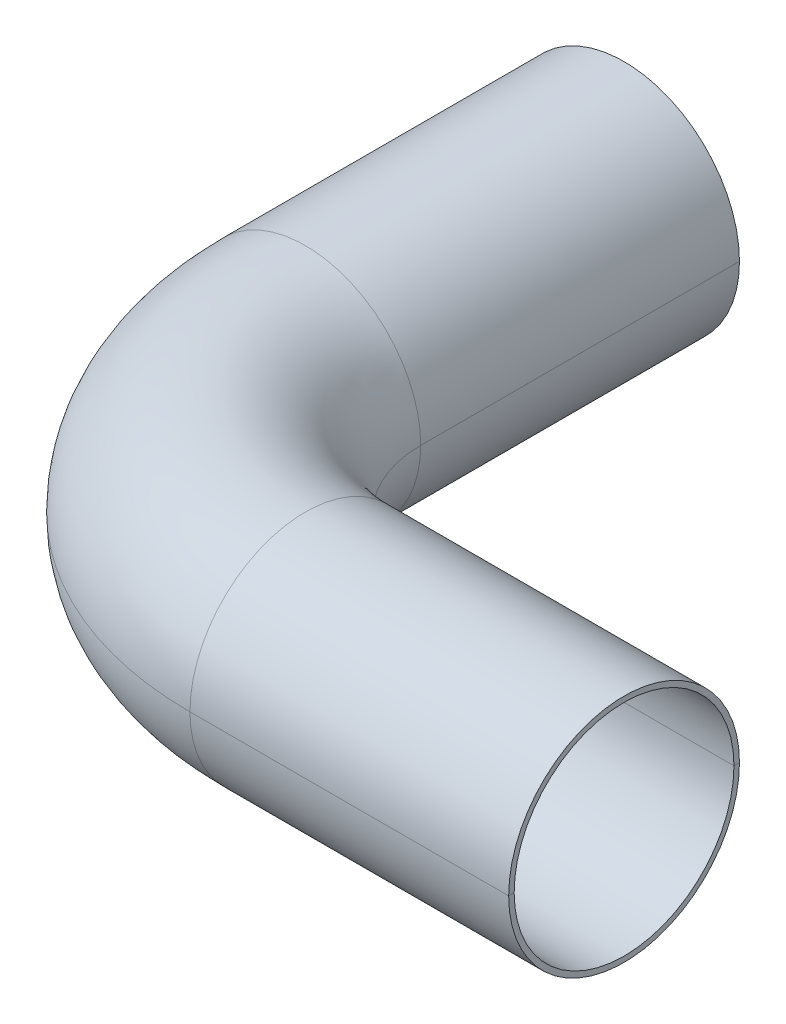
ISO-10303-21;
HEADER;
FILE_DESCRIPTION(('STEP AP214'),'2;1');
FILE_NAME('part.step','',(''),(''),'','','');
FILE_SCHEMA(('AUTOMOTIVE_DESIGN { 1 0 10303 214 1 1 1 1 }'));
ENDSEC;
DATA;
#1=APPLICATION_CONTEXT('core data for automotive mechanical design processes');
#2=APPLICATION_PROTOCOL_DEFINITION('international standard','automotive_design',2000,#1);
#3=PRODUCT_CONTEXT('',#1,'mechanical');
#4=PRODUCT('Part','Part','',(#3));
#5=PRODUCT_RELATED_PRODUCT_CATEGORY('part','',(#4));
#6=PRODUCT_DEFINITION_FORMATION('','',#4);
#7=PRODUCT_DEFINITION_CONTEXT('part definition',#1,'design');
#8=PRODUCT_DEFINITION('design','',#6,#7);
#9=PRODUCT_DEFINITION_SHAPE('','',#8);
#10=(LENGTH_UNIT() NAMED_UNIT(*) SI_UNIT(.MILLI.,.METRE.));
#11=(NAMED_UNIT(*) PLANE_ANGLE_UNIT() SI_UNIT($,.RADIAN.));
#12=(NAMED_UNIT(*) SI_UNIT($,.STERADIAN.) SOLID_ANGLE_UNIT());
#13=UNCERTAINTY_MEASURE_WITH_UNIT(LENGTH_MEASURE(1.E-05),#10,'distance_accuracy_value','');
#14=(GEOMETRIC_REPRESENTATION_CONTEXT(3) GLOBAL_UNCERTAINTY_ASSIGNED_CONTEXT((#13)) GLOBAL_UNIT_ASSIGNED_CONTEXT((#10,
#11,#12)) REPRESENTATION_CONTEXT('',''));
#15=CARTESIAN_POINT('',(0.,0.,0.));
#16=DIRECTION('',(0.,0.,1.));
#17=DIRECTION('',(1.,0.,0.));
#18=AXIS2_PLACEMENT_3D('',#15,#16,#17);
#19=CARTESIAN_POINT('',(106.68,-53.35,377.268224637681));
#20=DIRECTION('',(1.,0.,0.));
#21=DIRECTION('',(0.,0.,-1.));
#22=AXIS2_PLACEMENT_3D('',#19,#20,#21);
#23=PLANE('',#22);
#24=CARTESIAN_POINT('',(106.68,0.,254.));
#25=DIRECTION('',(1.,0.,0.));
#26=DIRECTION('',(0.,0.,-1.));
#27=AXIS2_PLACEMENT_3D('',#24,#25,#26);
#28=CIRCLE('',#27,53.34);
#29=CARTESIAN_POINT('',(106.68,0.,200.66));
#30=VERTEX_POINT('',#29);
#31=CARTESIAN_POINT('',(106.68,0.,307.34));
#32=VERTEX_POINT('',#31);
#33=EDGE_CURVE('E93',#30,#32,#28,.T.);
#34=ORIENTED_EDGE('',*,*,#33,.T.);
#35=DIRECTION('',(0.,0.,1.));
#36=VECTOR('',#35,1.);
#37=CARTESIAN_POINT('',(106.68,0.,-0.01));
#38=LINE('',#37,#36);
#39=CARTESIAN_POINT('',(106.68,0.,304.8));
#40=VERTEX_POINT('',#39);
#41=EDGE_CURVE('E100',#40,#32,#38,.T.);
#42=ORIENTED_EDGE('',*,*,#41,.F.);
#43=CARTESIAN_POINT('',(106.68,0.,254.));
#44=DIRECTION('',(1.,0.,0.));
#45=DIRECTION('',(0.,0.,-1.));
#46=AXIS2_PLACEMENT_3D('',#43,#44,#45);
#47=CIRCLE('',#46,50.8);
#48=CARTESIAN_POINT('',(106.68,0.,203.2));
#49=VERTEX_POINT('',#48);
#50=EDGE_CURVE('E53',#49,#40,#47,.T.);
#51=ORIENTED_EDGE('',*,*,#50,.F.);
#52=DIRECTION('',(0.,0.,1.));
#53=VECTOR('',#52,1.);
#54=CARTESIAN_POINT('',(106.68,0.,-0.01));
#55=LINE('',#54,#53);
#56=EDGE_CURVE('E107',#30,#49,#55,.T.);
#57=ORIENTED_EDGE('',*,*,#56,.F.);
#58=EDGE_LOOP('',(#34,#42,#51,#57));
#59=FACE_BOUND('',#58,.T.);
#60=ADVANCED_FACE('F49',(#59),#23,.T.);
#61=CARTESIAN_POINT('',(106.68,-53.35,147.32));
#62=DIRECTION('',(0.,0.,-1.));
#63=DIRECTION('',(-1.,0.,0.));
#64=AXIS2_PLACEMENT_3D('',#61,#62,#63);
#65=PLANE('',#64);
#66=DIRECTION('',(1.,0.,0.));
#67=VECTOR('',#66,1.);
#68=CARTESIAN_POINT('',(-95.1259909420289,0.,147.32));
#69=LINE('',#68,#67);
#70=CARTESIAN_POINT('',(50.8,0.,147.32));
#71=VERTEX_POINT('',#70);
#72=CARTESIAN_POINT('',(53.34,0.,147.32));
#73=VERTEX_POINT('',#72);
#74=EDGE_CURVE('E112',#71,#73,#69,.T.);
#75=ORIENTED_EDGE('',*,*,#74,.F.);
#76=CARTESIAN_POINT('',(0.,0.,147.32));
#77=DIRECTION('',(0.,0.,1.));
#78=DIRECTION('',(1.,0.,0.));
#79=AXIS2_PLACEMENT_3D('',#76,#77,#78);
#80=CIRCLE('',#79,50.8);
#81=CARTESIAN_POINT('',(-50.8,0.,147.32));
#82=VERTEX_POINT('',#81);
#83=EDGE_CURVE('E103',#71,#82,#80,.T.);
#84=ORIENTED_EDGE('',*,*,#83,.T.);
#85=DIRECTION('',(1.,0.,0.));
#86=VECTOR('',#85,1.);
#87=CARTESIAN_POINT('',(-95.1259909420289,0.,147.32));
#88=LINE('',#87,#86);
#89=CARTESIAN_POINT('',(-53.34,0.,147.32));
#90=VERTEX_POINT('',#89);
#91=EDGE_CURVE('E102',#90,#82,#88,.T.);
#92=ORIENTED_EDGE('',*,*,#91,.F.);
#93=CARTESIAN_POINT('',(0.,0.,147.32));
#94=DIRECTION('',(0.,0.,1.));
#95=DIRECTION('',(1.,0.,0.));
#96=AXIS2_PLACEMENT_3D('',#93,#94,#95);
#97=CIRCLE('',#96,53.34);
#98=EDGE_CURVE('E66',#73,#90,#97,.T.);
#99=ORIENTED_EDGE('',*,*,#98,.F.);
#100=EDGE_LOOP('',(#75,#84,#92,#99));
#101=FACE_BOUND('',#100,.T.);
#102=ADVANCED_FACE('F123',(#101),#65,.T.);
#103=CARTESIAN_POINT('',(-95.1259909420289,0.,-0.01));
#104=DIRECTION('',(0.,-1.,0.));
#105=DIRECTION('',(0.,0.,-1.));
#106=AXIS2_PLACEMENT_3D('',#103,#104,#105);
#107=PLANE('',#106);
#108=CARTESIAN_POINT('',(106.68,0.,147.32));
#109=DIRECTION('',(0.,1.,0.));
#110=DIRECTION('',(0.,0.,1.));
#111=AXIS2_PLACEMENT_3D('',#108,#109,#110);
#112=CIRCLE('',#111,53.34);
#113=EDGE_CURVE('E96',#30,#73,#112,.F.);
#114=ORIENTED_EDGE('',*,*,#113,.F.);
#115=ORIENTED_EDGE('',*,*,#56,.T.);
#116=CARTESIAN_POINT('',(106.68,0.,147.32));
#117=DIRECTION('',(0.,1.,0.));
#118=DIRECTION('',(0.,0.,1.));
#119=AXIS2_PLACEMENT_3D('',#116,#117,#118);
#120=CIRCLE('',#119,55.88);
#121=EDGE_CURVE('E13',#49,#71,#120,.F.);
#122=ORIENTED_EDGE('',*,*,#121,.T.);
#123=ORIENTED_EDGE('',*,*,#74,.T.);
#124=EDGE_LOOP('',(#114,#115,#122,#123));
#125=FACE_BOUND('',#124,.T.);
#126=ADVANCED_FACE('F122',(#125),#107,.T.);
#127=CARTESIAN_POINT('',(106.68,0.,147.32));
#128=DIRECTION('',(0.,-1.,0.));
#129=DIRECTION('',(0.,0.,-1.));
#130=AXIS2_PLACEMENT_3D('',#127,#128,#129);
#131=CIRCLE('',#130,157.48);
#132=EDGE_CURVE('E58',#82,#40,#131,.F.);
#133=ORIENTED_EDGE('',*,*,#132,.T.);
#134=ORIENTED_EDGE('',*,*,#41,.T.);
#135=CARTESIAN_POINT('',(106.68,0.,147.32));
#136=DIRECTION('',(0.,-1.,0.));
#137=DIRECTION('',(0.,0.,-1.));
#138=AXIS2_PLACEMENT_3D('',#135,#136,#137);
#139=CIRCLE('',#138,160.02);
#140=EDGE_CURVE('E89',#90,#32,#139,.F.);
#141=ORIENTED_EDGE('',*,*,#140,.F.);
#142=ORIENTED_EDGE('',*,*,#91,.T.);
#143=EDGE_LOOP('',(#133,#134,#141,#142));
#144=FACE_BOUND('',#143,.T.);
#145=ADVANCED_FACE('F51',(#144),#107,.T.);
#146=CARTESIAN_POINT('',(106.68,0.,147.32));
#147=DIRECTION('',(0.,1.,0.));
#148=DIRECTION('',(0.,0.,1.));
#149=AXIS2_PLACEMENT_3D('',#146,#147,#148);
#150=TOROIDAL_SURFACE('',#149,106.68,53.34);
#151=ORIENTED_EDGE('',*,*,#98,.T.);
#152=ORIENTED_EDGE('',*,*,#140,.T.);
#153=ORIENTED_EDGE('',*,*,#33,.F.);
#154=ORIENTED_EDGE('',*,*,#113,.T.);
#155=EDGE_LOOP('',(#151,#152,#153,#154));
#156=FACE_BOUND('',#155,.T.);
#157=ADVANCED_FACE('F91',(#156),#150,.T.);
#158=CARTESIAN_POINT('',(106.68,0.,147.32));
#159=DIRECTION('',(0.,1.,0.));
#160=DIRECTION('',(0.,0.,1.));
#161=AXIS2_PLACEMENT_3D('',#158,#159,#160);
#162=TOROIDAL_SURFACE('',#161,106.68,50.8);
#163=ORIENTED_EDGE('',*,*,#132,.F.);
#164=ORIENTED_EDGE('',*,*,#83,.F.);
#165=ORIENTED_EDGE('',*,*,#121,.F.);
#166=ORIENTED_EDGE('',*,*,#50,.T.);
#167=EDGE_LOOP('',(#163,#164,#165,#166));
#168=FACE_BOUND('',#167,.T.);
#169=ADVANCED_FACE('F120',(#168),#162,.F.);
#170=CLOSED_SHELL('',(#60,#102,#126,#145,#157,#169));
#171=MANIFOLD_SOLID_BREP('B2',#170);
#172=CARTESIAN_POINT('',(106.68,-53.35,377.268224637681));
#173=DIRECTION('',(1.,0.,0.));
#174=DIRECTION('',(0.,0.,-1.));
#175=AXIS2_PLACEMENT_3D('',#172,#173,#174);
#176=PLANE('',#175);
#177=CARTESIAN_POINT('',(106.68,0.,254.));
#178=DIRECTION('',(1.,0.,0.));
#179=DIRECTION('',(0.,0.,-1.));
#180=AXIS2_PLACEMENT_3D('',#177,#178,#179);
#181=CIRCLE('',#180,53.34);
#182=CARTESIAN_POINT('',(106.68,0.,200.66));
#183=VERTEX_POINT('',#182);
#184=CARTESIAN_POINT('',(106.68,0.,307.34));
#185=VERTEX_POINT('',#184);
#186=EDGE_CURVE('E230',#183,#185,#181,.T.);
#187=ORIENTED_EDGE('',*,*,#186,.F.);
#188=DIRECTION('',(0.,0.,1.));
#189=VECTOR('',#188,1.);
#190=CARTESIAN_POINT('',(106.68,0.,-0.01));
#191=LINE('',#190,#189);
#192=CARTESIAN_POINT('',(106.68,0.,203.2));
#193=VERTEX_POINT('',#192);
#194=EDGE_CURVE('E207',#183,#193,#191,.T.);
#195=ORIENTED_EDGE('',*,*,#194,.T.);
#196=CARTESIAN_POINT('',(106.68,0.,254.));
#197=DIRECTION('',(1.,0.,0.));
#198=DIRECTION('',(0.,0.,-1.));
#199=AXIS2_PLACEMENT_3D('',#196,#197,#198);
#200=CIRCLE('',#199,50.8);
#201=CARTESIAN_POINT('',(106.68,0.,304.8));
#202=VERTEX_POINT('',#201);
#203=EDGE_CURVE('E186',#193,#202,#200,.T.);
#204=ORIENTED_EDGE('',*,*,#203,.T.);
#205=DIRECTION('',(0.,0.,1.));
#206=VECTOR('',#205,1.);
#207=CARTESIAN_POINT('',(106.68,0.,-0.01));
#208=LINE('',#207,#206);
#209=EDGE_CURVE('E199',#202,#185,#208,.T.);
#210=ORIENTED_EDGE('',*,*,#209,.T.);
#211=EDGE_LOOP('',(#187,#195,#204,#210));
#212=FACE_BOUND('',#211,.T.);
#213=ADVANCED_FACE('F182',(#212),#176,.F.);
#214=CARTESIAN_POINT('',(-95.1259909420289,0.,-0.01));
#215=DIRECTION('',(0.,-1.,0.));
#216=DIRECTION('',(0.,0.,-1.));
#217=AXIS2_PLACEMENT_3D('',#214,#215,#216);
#218=PLANE('',#217);
#219=ORIENTED_EDGE('',*,*,#209,.F.);
#220=DIRECTION('',(1.,0.,0.));
#221=VECTOR('',#220,1.);
#222=CARTESIAN_POINT('',(106.68,0.,304.8));
#223=LINE('',#222,#221);
#224=CARTESIAN_POINT('',(254.,0.,304.8));
#225=VERTEX_POINT('',#224);
#226=EDGE_CURVE('E47',#202,#225,#223,.T.);
#227=ORIENTED_EDGE('',*,*,#226,.T.);
#228=DIRECTION('',(0.,0.,-1.));
#229=VECTOR('',#228,1.);
#230=CARTESIAN_POINT('',(254.,0.,254.));
#231=LINE('',#230,#229);
#232=CARTESIAN_POINT('',(254.,0.,307.34));
#233=VERTEX_POINT('',#232);
#234=EDGE_CURVE('E241',#233,#225,#231,.T.);
#235=ORIENTED_EDGE('',*,*,#234,.F.);
#236=DIRECTION('',(1.,0.,0.));
#237=VECTOR('',#236,1.);
#238=CARTESIAN_POINT('',(106.68,0.,307.34));
#239=LINE('',#238,#237);
#240=EDGE_CURVE('E235',#185,#233,#239,.T.);
#241=ORIENTED_EDGE('',*,*,#240,.F.);
#242=EDGE_LOOP('',(#219,#227,#235,#241));
#243=FACE_BOUND('',#242,.T.);
#244=ADVANCED_FACE('F255',(#243),#218,.T.);
#245=ORIENTED_EDGE('',*,*,#194,.F.);
#246=DIRECTION('',(1.,0.,0.));
#247=VECTOR('',#246,1.);
#248=CARTESIAN_POINT('',(106.68,0.,200.66));
#249=LINE('',#248,#247);
#250=CARTESIAN_POINT('',(254.,0.,200.66));
#251=VERTEX_POINT('',#250);
#252=EDGE_CURVE('E233',#251,#183,#249,.F.);
#253=ORIENTED_EDGE('',*,*,#252,.F.);
#254=CARTESIAN_POINT('',(254.,0.,203.2));
#255=VERTEX_POINT('',#254);
#256=EDGE_CURVE('E232',#255,#251,#231,.T.);
#257=ORIENTED_EDGE('',*,*,#256,.F.);
#258=DIRECTION('',(1.,0.,0.));
#259=VECTOR('',#258,1.);
#260=CARTESIAN_POINT('',(106.68,0.,203.2));
#261=LINE('',#260,#259);
#262=EDGE_CURVE('E191',#255,#193,#261,.F.);
#263=ORIENTED_EDGE('',*,*,#262,.T.);
#264=EDGE_LOOP('',(#245,#253,#257,#263));
#265=FACE_BOUND('',#264,.T.);
#266=ADVANCED_FACE('F184',(#265),#218,.T.);
#267=CARTESIAN_POINT('',(106.68,0.,254.));
#268=DIRECTION('',(1.,0.,0.));
#269=DIRECTION('',(0.,0.,-1.));
#270=AXIS2_PLACEMENT_3D('',#267,#268,#269);
#271=CYLINDRICAL_SURFACE('',#270,53.34);
#272=CARTESIAN_POINT('',(254.,0.,254.));
#273=DIRECTION('',(1.,0.,0.));
#274=DIRECTION('',(0.,0.,-1.));
#275=AXIS2_PLACEMENT_3D('',#272,#273,#274);
#276=CIRCLE('',#275,53.34);
#277=EDGE_CURVE('E247',#251,#233,#276,.T.);
#278=ORIENTED_EDGE('',*,*,#277,.F.);
#279=ORIENTED_EDGE('',*,*,#252,.T.);
#280=ORIENTED_EDGE('',*,*,#186,.T.);
#281=ORIENTED_EDGE('',*,*,#240,.T.);
#282=EDGE_LOOP('',(#278,#279,#280,#281));
#283=FACE_BOUND('',#282,.T.);
#284=ADVANCED_FACE('F253',(#283),#271,.T.);
#285=CARTESIAN_POINT('',(106.68,0.,254.));
#286=DIRECTION('',(1.,0.,0.));
#287=DIRECTION('',(0.,0.,-1.));
#288=AXIS2_PLACEMENT_3D('',#285,#286,#287);
#289=CYLINDRICAL_SURFACE('',#288,50.8);
#290=ORIENTED_EDGE('',*,*,#262,.F.);
#291=CARTESIAN_POINT('',(254.,0.,254.));
#292=DIRECTION('',(1.,0.,0.));
#293=DIRECTION('',(0.,0.,-1.));
#294=AXIS2_PLACEMENT_3D('',#291,#292,#293);
#295=CIRCLE('',#294,50.8);
#296=EDGE_CURVE('E243',#255,#225,#295,.T.);
#297=ORIENTED_EDGE('',*,*,#296,.T.);
#298=ORIENTED_EDGE('',*,*,#226,.F.);
#299=ORIENTED_EDGE('',*,*,#203,.F.);
#300=EDGE_LOOP('',(#290,#297,#298,#299));
#301=FACE_BOUND('',#300,.T.);
#302=ADVANCED_FACE('F227',(#301),#289,.F.);
#303=CARTESIAN_POINT('',(254.,0.,254.));
#304=DIRECTION('',(1.,0.,0.));
#305=DIRECTION('',(0.,0.,-1.));
#306=AXIS2_PLACEMENT_3D('',#303,#304,#305);
#307=PLANE('',#306);
#308=ORIENTED_EDGE('',*,*,#277,.T.);
#309=ORIENTED_EDGE('',*,*,#234,.T.);
#310=ORIENTED_EDGE('',*,*,#296,.F.);
#311=ORIENTED_EDGE('',*,*,#256,.T.);
#312=EDGE_LOOP('',(#308,#309,#310,#311));
#313=FACE_BOUND('',#312,.T.);
#314=ADVANCED_FACE('F252',(#313),#307,.T.);
#315=CLOSED_SHELL('',(#213,#244,#266,#284,#302,#314));
#316=MANIFOLD_SOLID_BREP('B7',#315);
#317=CARTESIAN_POINT('',(106.68,-53.35,147.32));
#318=DIRECTION('',(0.,0.,-1.));
#319=DIRECTION('',(-1.,0.,0.));
#320=AXIS2_PLACEMENT_3D('',#317,#318,#319);
#321=PLANE('',#320);
#322=DIRECTION('',(1.,0.,0.));
#323=VECTOR('',#322,1.);
#324=CARTESIAN_POINT('',(-95.1259909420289,0.,147.32));
#325=LINE('',#324,#323);
#326=CARTESIAN_POINT('',(50.8,0.,147.32));
#327=VERTEX_POINT('',#326);
#328=CARTESIAN_POINT('',(53.34,0.,147.32));
#329=VERTEX_POINT('',#328);
#330=EDGE_CURVE('E317',#327,#329,#325,.T.);
#331=ORIENTED_EDGE('',*,*,#330,.T.);
#332=CARTESIAN_POINT('',(0.,0.,147.32));
#333=DIRECTION('',(0.,0.,1.));
#334=DIRECTION('',(1.,0.,0.));
#335=AXIS2_PLACEMENT_3D('',#332,#333,#334);
#336=CIRCLE('',#335,53.34);
#337=CARTESIAN_POINT('',(-53.34,0.,147.32));
#338=VERTEX_POINT('',#337);
#339=EDGE_CURVE('E180',#329,#338,#336,.T.);
#340=ORIENTED_EDGE('',*,*,#339,.T.);
#341=DIRECTION('',(1.,0.,0.));
#342=VECTOR('',#341,1.);
#343=CARTESIAN_POINT('',(-95.1259909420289,0.,147.32));
#344=LINE('',#343,#342);
#345=CARTESIAN_POINT('',(-50.8,0.,147.32));
#346=VERTEX_POINT('',#345);
#347=EDGE_CURVE('E335',#338,#346,#344,.T.);
#348=ORIENTED_EDGE('',*,*,#347,.T.);
#349=CARTESIAN_POINT('',(0.,0.,147.32));
#350=DIRECTION('',(0.,0.,1.));
#351=DIRECTION('',(1.,0.,0.));
#352=AXIS2_PLACEMENT_3D('',#349,#350,#351);
#353=CIRCLE('',#352,50.8);
#354=EDGE_CURVE('E373',#327,#346,#353,.T.);
#355=ORIENTED_EDGE('',*,*,#354,.F.);
#356=EDGE_LOOP('',(#331,#340,#348,#355));
#357=FACE_BOUND('',#356,.T.);
#358=ADVANCED_FACE('F314',(#357),#321,.F.);
#359=CARTESIAN_POINT('',(0.,0.,0.));
#360=DIRECTION('',(0.,0.,1.));
#361=DIRECTION('',(1.,0.,0.));
#362=AXIS2_PLACEMENT_3D('',#359,#360,#361);
#363=PLANE('',#362);
#364=DIRECTION('',(1.,0.,0.));
#365=VECTOR('',#364,1.);
#366=CARTESIAN_POINT('',(0.,0.,0.));
#367=LINE('',#366,#365);
#368=CARTESIAN_POINT('',(-53.34,0.,0.));
#369=VERTEX_POINT('',#368);
#370=CARTESIAN_POINT('',(-50.8,0.,0.));
#371=VERTEX_POINT('',#370);
#372=EDGE_CURVE('E376',#369,#371,#367,.T.);
#373=ORIENTED_EDGE('',*,*,#372,.F.);
#374=CARTESIAN_POINT('',(0.,0.,0.));
#375=DIRECTION('',(0.,0.,1.));
#376=DIRECTION('',(1.,0.,0.));
#377=AXIS2_PLACEMENT_3D('',#374,#375,#376);
#378=CIRCLE('',#377,53.34);
#379=CARTESIAN_POINT('',(53.34,0.,0.));
#380=VERTEX_POINT('',#379);
#381=EDGE_CURVE('E365',#380,#369,#378,.T.);
#382=ORIENTED_EDGE('',*,*,#381,.F.);
#383=CARTESIAN_POINT('',(50.8,0.,0.));
#384=VERTEX_POINT('',#383);
#385=EDGE_CURVE('E372',#384,#380,#367,.T.);
#386=ORIENTED_EDGE('',*,*,#385,.F.);
#387=CARTESIAN_POINT('',(0.,0.,0.));
#388=DIRECTION('',(0.,0.,1.));
#389=DIRECTION('',(1.,0.,0.));
#390=AXIS2_PLACEMENT_3D('',#387,#388,#389);
#391=CIRCLE('',#390,50.8);
#392=EDGE_CURVE('E356',#384,#371,#391,.T.);
#393=ORIENTED_EDGE('',*,*,#392,.T.);
#394=EDGE_LOOP('',(#373,#382,#386,#393));
#395=FACE_BOUND('',#394,.T.);
#396=ADVANCED_FACE('F375',(#395),#363,.F.);
#397=CARTESIAN_POINT('',(-95.1259909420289,0.,-0.01));
#398=DIRECTION('',(0.,-1.,0.));
#399=DIRECTION('',(0.,0.,-1.));
#400=AXIS2_PLACEMENT_3D('',#397,#398,#399);
#401=PLANE('',#400);
#402=ORIENTED_EDGE('',*,*,#330,.F.);
#403=DIRECTION('',(0.,0.,-1.));
#404=VECTOR('',#403,1.);
#405=CARTESIAN_POINT('',(50.8,0.,147.32));
#406=LINE('',#405,#404);
#407=EDGE_CURVE('E359',#384,#327,#406,.F.);
#408=ORIENTED_EDGE('',*,*,#407,.F.);
#409=ORIENTED_EDGE('',*,*,#385,.T.);
#410=DIRECTION('',(0.,0.,-1.));
#411=VECTOR('',#410,1.);
#412=CARTESIAN_POINT('',(53.34,0.,147.32));
#413=LINE('',#412,#411);
#414=EDGE_CURVE('E378',#380,#329,#413,.F.);
#415=ORIENTED_EDGE('',*,*,#414,.T.);
#416=EDGE_LOOP('',(#402,#408,#409,#415));
#417=FACE_BOUND('',#416,.T.);
#418=ADVANCED_FACE('F370',(#417),#401,.T.);
#419=ORIENTED_EDGE('',*,*,#347,.F.);
#420=DIRECTION('',(0.,0.,-1.));
#421=VECTOR('',#420,1.);
#422=CARTESIAN_POINT('',(-53.34,0.,147.32));
#423=LINE('',#422,#421);
#424=EDGE_CURVE('E384',#338,#369,#423,.T.);
#425=ORIENTED_EDGE('',*,*,#424,.T.);
#426=ORIENTED_EDGE('',*,*,#372,.T.);
#427=DIRECTION('',(0.,0.,-1.));
#428=VECTOR('',#427,1.);
#429=CARTESIAN_POINT('',(-50.8,0.,147.32));
#430=LINE('',#429,#428);
#431=EDGE_CURVE('E360',#346,#371,#430,.T.);
#432=ORIENTED_EDGE('',*,*,#431,.F.);
#433=EDGE_LOOP('',(#419,#425,#426,#432));
#434=FACE_BOUND('',#433,.T.);
#435=ADVANCED_FACE('F386',(#434),#401,.T.);
#436=CARTESIAN_POINT('',(0.,0.,147.32));
#437=DIRECTION('',(0.,0.,-1.));
#438=DIRECTION('',(-1.,0.,0.));
#439=AXIS2_PLACEMENT_3D('',#436,#437,#438);
#440=CYLINDRICAL_SURFACE('',#439,53.34);
#441=ORIENTED_EDGE('',*,*,#424,.F.);
#442=ORIENTED_EDGE('',*,*,#339,.F.);
#443=ORIENTED_EDGE('',*,*,#414,.F.);
#444=ORIENTED_EDGE('',*,*,#381,.T.);
#445=EDGE_LOOP('',(#441,#442,#443,#444));
#446=FACE_BOUND('',#445,.T.);
#447=ADVANCED_FACE('F387',(#446),#440,.T.);
#448=CARTESIAN_POINT('',(0.,0.,147.32));
#449=DIRECTION('',(0.,0.,-1.));
#450=DIRECTION('',(-1.,0.,0.));
#451=AXIS2_PLACEMENT_3D('',#448,#449,#450);
#452=CYLINDRICAL_SURFACE('',#451,50.8);
#453=ORIENTED_EDGE('',*,*,#354,.T.);
#454=ORIENTED_EDGE('',*,*,#431,.T.);
#455=ORIENTED_EDGE('',*,*,#392,.F.);
#456=ORIENTED_EDGE('',*,*,#407,.T.);
#457=EDGE_LOOP('',(#453,#454,#455,#456));
#458=FACE_BOUND('',#457,.T.);
#459=ADVANCED_FACE('F358',(#458),#452,.F.);
#460=CLOSED_SHELL('',(#358,#396,#418,#435,#447,#459));
#461=MANIFOLD_SOLID_BREP('B41',#460);
#462=CARTESIAN_POINT('',(106.68,-53.35,377.268224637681));
#463=DIRECTION('',(1.,0.,0.));
#464=DIRECTION('',(0.,0.,-1.));
#465=AXIS2_PLACEMENT_3D('',#462,#463,#464);
#466=PLANE('',#465);
#467=DIRECTION('',(0.,0.,1.));
#468=VECTOR('',#467,1.);
#469=CARTESIAN_POINT('',(106.68,0.,-0.01));
#470=LINE('',#469,#468);
#471=CARTESIAN_POINT('',(106.68,0.,200.66));
#472=VERTEX_POINT('',#471);
#473=CARTESIAN_POINT('',(106.68,0.,203.2));
#474=VERTEX_POINT('',#473);
#475=EDGE_CURVE('E502',#472,#474,#470,.T.);
#476=ORIENTED_EDGE('',*,*,#475,.T.);
#477=CARTESIAN_POINT('',(106.68,0.,254.));
#478=DIRECTION('',(1.,0.,0.));
#479=DIRECTION('',(0.,0.,-1.));
#480=AXIS2_PLACEMENT_3D('',#477,#478,#479);
#481=CIRCLE('',#480,50.8);
#482=CARTESIAN_POINT('',(106.68,0.,304.8));
#483=VERTEX_POINT('',#482);
#484=EDGE_CURVE('E449',#483,#474,#481,.T.);
#485=ORIENTED_EDGE('',*,*,#484,.F.);
#486=DIRECTION('',(0.,0.,1.));
#487=VECTOR('',#486,1.);
#488=CARTESIAN_POINT('',(106.68,0.,-0.01));
#489=LINE('',#488,#487);
#490=CARTESIAN_POINT('',(106.68,0.,307.34));
#491=VERTEX_POINT('',#490);
#492=EDGE_CURVE('E485',#483,#491,#489,.T.);
#493=ORIENTED_EDGE('',*,*,#492,.T.);
#494=CARTESIAN_POINT('',(106.68,0.,254.));
#495=DIRECTION('',(1.,0.,0.));
#496=DIRECTION('',(0.,0.,-1.));
#497=AXIS2_PLACEMENT_3D('',#494,#495,#496);
#498=CIRCLE('',#497,53.34);
#499=EDGE_CURVE('E495',#491,#472,#498,.T.);
#500=ORIENTED_EDGE('',*,*,#499,.T.);
#501=EDGE_LOOP('',(#476,#485,#493,#500));
#502=FACE_BOUND('',#501,.T.);
#503=ADVANCED_FACE('F445',(#502),#466,.T.);
#504=CARTESIAN_POINT('',(106.68,-53.35,147.32));
#505=DIRECTION('',(0.,0.,-1.));
#506=DIRECTION('',(-1.,0.,0.));
#507=AXIS2_PLACEMENT_3D('',#504,#505,#506);
#508=PLANE('',#507);
#509=CARTESIAN_POINT('',(0.,0.,147.32));
#510=DIRECTION('',(0.,0.,1.));
#511=DIRECTION('',(1.,0.,0.));
#512=AXIS2_PLACEMENT_3D('',#509,#510,#511);
#513=CIRCLE('',#512,50.8);
#514=CARTESIAN_POINT('',(-50.8,0.,147.32));
#515=VERTEX_POINT('',#514);
#516=CARTESIAN_POINT('',(50.8,0.,147.32));
#517=VERTEX_POINT('',#516);
#518=EDGE_CURVE('E500',#515,#517,#513,.T.);
#519=ORIENTED_EDGE('',*,*,#518,.T.);
#520=DIRECTION('',(1.,0.,0.));
#521=VECTOR('',#520,1.);
#522=CARTESIAN_POINT('',(-95.1259909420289,0.,147.32));
#523=LINE('',#522,#521);
#524=CARTESIAN_POINT('',(53.34,0.,147.32));
#525=VERTEX_POINT('',#524);
#526=EDGE_CURVE('E499',#517,#525,#523,.T.);
#527=ORIENTED_EDGE('',*,*,#526,.T.);
#528=CARTESIAN_POINT('',(0.,0.,147.32));
#529=DIRECTION('',(0.,0.,1.));
#530=DIRECTION('',(1.,0.,0.));
#531=AXIS2_PLACEMENT_3D('',#528,#529,#530);
#532=CIRCLE('',#531,53.34);
#533=CARTESIAN_POINT('',(-53.34,0.,147.32));
#534=VERTEX_POINT('',#533);
#535=EDGE_CURVE('E312',#534,#525,#532,.T.);
#536=ORIENTED_EDGE('',*,*,#535,.F.);
#537=DIRECTION('',(1.,0.,0.));
#538=VECTOR('',#537,1.);
#539=CARTESIAN_POINT('',(-95.1259909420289,0.,147.32));
#540=LINE('',#539,#538);
#541=EDGE_CURVE('E487',#534,#515,#540,.T.);
#542=ORIENTED_EDGE('',*,*,#541,.T.);
#543=EDGE_LOOP('',(#519,#527,#536,#542));
#544=FACE_BOUND('',#543,.T.);
#545=ADVANCED_FACE('F517',(#544),#508,.T.);
#546=CARTESIAN_POINT('',(-95.1259909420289,0.,-0.01));
#547=DIRECTION('',(0.,-1.,0.));
#548=DIRECTION('',(0.,0.,-1.));
#549=AXIS2_PLACEMENT_3D('',#546,#547,#548);
#550=PLANE('',#549);
#551=ORIENTED_EDGE('',*,*,#475,.F.);
#552=CARTESIAN_POINT('',(106.68,0.,147.32));
#553=DIRECTION('',(0.,1.,0.));
#554=DIRECTION('',(0.,0.,1.));
#555=AXIS2_PLACEMENT_3D('',#552,#553,#554);
#556=CIRCLE('',#555,53.34);
#557=EDGE_CURVE('E490',#472,#525,#556,.F.);
#558=ORIENTED_EDGE('',*,*,#557,.T.);
#559=ORIENTED_EDGE('',*,*,#526,.F.);
#560=CARTESIAN_POINT('',(106.68,0.,147.32));
#561=DIRECTION('',(0.,1.,0.));
#562=DIRECTION('',(0.,0.,1.));
#563=AXIS2_PLACEMENT_3D('',#560,#561,#562);
#564=CIRCLE('',#563,55.88);
#565=EDGE_CURVE('E511',#474,#517,#564,.F.);
#566=ORIENTED_EDGE('',*,*,#565,.F.);
#567=EDGE_LOOP('',(#551,#558,#559,#566));
#568=FACE_BOUND('',#567,.T.);
#569=ADVANCED_FACE('F519',(#568),#550,.F.);
#570=ORIENTED_EDGE('',*,*,#492,.F.);
#571=CARTESIAN_POINT('',(106.68,0.,147.32));
#572=DIRECTION('',(0.,-1.,0.));
#573=DIRECTION('',(0.,0.,-1.));
#574=AXIS2_PLACEMENT_3D('',#571,#572,#573);
#575=CIRCLE('',#574,157.48);
#576=EDGE_CURVE('E489',#515,#483,#575,.F.);
#577=ORIENTED_EDGE('',*,*,#576,.F.);
#578=ORIENTED_EDGE('',*,*,#541,.F.);
#579=CARTESIAN_POINT('',(106.68,0.,147.32));
#580=DIRECTION('',(0.,-1.,0.));
#581=DIRECTION('',(0.,0.,-1.));
#582=AXIS2_PLACEMENT_3D('',#579,#580,#581);
#583=CIRCLE('',#582,160.02);
#584=EDGE_CURVE('E483',#534,#491,#583,.F.);
#585=ORIENTED_EDGE('',*,*,#584,.T.);
#586=EDGE_LOOP('',(#570,#577,#578,#585));
#587=FACE_BOUND('',#586,.T.);
#588=ADVANCED_FACE('F447',(#587),#550,.F.);
#589=CARTESIAN_POINT('',(106.68,0.,147.32));
#590=DIRECTION('',(0.,1.,0.));
#591=DIRECTION('',(0.,0.,1.));
#592=AXIS2_PLACEMENT_3D('',#589,#590,#591);
#593=TOROIDAL_SURFACE('',#592,106.68,53.34);
#594=ORIENTED_EDGE('',*,*,#584,.F.);
#595=ORIENTED_EDGE('',*,*,#535,.T.);
#596=ORIENTED_EDGE('',*,*,#557,.F.);
#597=ORIENTED_EDGE('',*,*,#499,.F.);
#598=EDGE_LOOP('',(#594,#595,#596,#597));
#599=FACE_BOUND('',#598,.T.);
#600=ADVANCED_FACE('F496',(#599),#593,.T.);
#601=CARTESIAN_POINT('',(106.68,0.,147.32));
#602=DIRECTION('',(0.,1.,0.));
#603=DIRECTION('',(0.,0.,1.));
#604=AXIS2_PLACEMENT_3D('',#601,#602,#603);
#605=TOROIDAL_SURFACE('',#604,106.68,50.8);
#606=ORIENTED_EDGE('',*,*,#518,.F.);
#607=ORIENTED_EDGE('',*,*,#576,.T.);
#608=ORIENTED_EDGE('',*,*,#484,.T.);
#609=ORIENTED_EDGE('',*,*,#565,.T.);
#610=EDGE_LOOP('',(#606,#607,#608,#609));
#611=FACE_BOUND('',#610,.T.);
#612=ADVANCED_FACE('F515',(#611),#605,.F.);
#613=CLOSED_SHELL('',(#503,#545,#569,#588,#600,#612));
#614=MANIFOLD_SOLID_BREP('B174_NOT_SHOWN',#613);
#615=CARTESIAN_POINT('',(106.68,-53.35,377.268224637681));
#616=DIRECTION('',(1.,0.,0.));
#617=DIRECTION('',(0.,0.,-1.));
#618=AXIS2_PLACEMENT_3D('',#615,#616,#617);
#619=PLANE('',#618);
#620=DIRECTION('',(0.,0.,1.));
#621=VECTOR('',#620,1.);
#622=CARTESIAN_POINT('',(106.68,0.,-0.01));
#623=LINE('',#622,#621);
#624=CARTESIAN_POINT('',(106.68,0.,200.66));
#625=VERTEX_POINT('',#624);
#626=CARTESIAN_POINT('',(106.68,0.,203.2));
#627=VERTEX_POINT('',#626);
#628=EDGE_CURVE('E617',#625,#627,#623,.T.);
#629=ORIENTED_EDGE('',*,*,#628,.F.);
#630=CARTESIAN_POINT('',(106.68,0.,254.));
#631=DIRECTION('',(1.,0.,0.));
#632=DIRECTION('',(0.,0.,-1.));
#633=AXIS2_PLACEMENT_3D('',#630,#631,#632);
#634=CIRCLE('',#633,53.34);
#635=CARTESIAN_POINT('',(106.68,0.,307.34));
#636=VERTEX_POINT('',#635);
#637=EDGE_CURVE('E443',#636,#625,#634,.T.);
#638=ORIENTED_EDGE('',*,*,#637,.F.);
#639=DIRECTION('',(0.,0.,1.));
#640=VECTOR('',#639,1.);
#641=CARTESIAN_POINT('',(106.68,0.,-0.01));
#642=LINE('',#641,#640);
#643=CARTESIAN_POINT('',(106.68,0.,304.8));
#644=VERTEX_POINT('',#643);
#645=EDGE_CURVE('E593',#644,#636,#642,.T.);
#646=ORIENTED_EDGE('',*,*,#645,.F.);
#647=CARTESIAN_POINT('',(106.68,0.,254.));
#648=DIRECTION('',(1.,0.,0.));
#649=DIRECTION('',(0.,0.,-1.));
#650=AXIS2_PLACEMENT_3D('',#647,#648,#649);
#651=CIRCLE('',#650,50.8);
#652=EDGE_CURVE('E581',#644,#627,#651,.T.);
#653=ORIENTED_EDGE('',*,*,#652,.T.);
#654=EDGE_LOOP('',(#629,#638,#646,#653));
#655=FACE_BOUND('',#654,.T.);
#656=ADVANCED_FACE('F577',(#655),#619,.F.);
#657=CARTESIAN_POINT('',(-95.1259909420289,0.,-0.01));
#658=DIRECTION('',(0.,-1.,0.));
#659=DIRECTION('',(0.,0.,-1.));
#660=AXIS2_PLACEMENT_3D('',#657,#658,#659);
#661=PLANE('',#660);
#662=DIRECTION('',(1.,0.,0.));
#663=VECTOR('',#662,1.);
#664=CARTESIAN_POINT('',(106.68,0.,304.8));
#665=LINE('',#664,#663);
#666=CARTESIAN_POINT('',(254.,0.,304.8));
#667=VERTEX_POINT('',#666);
#668=EDGE_CURVE('E631',#644,#667,#665,.T.);
#669=ORIENTED_EDGE('',*,*,#668,.F.);
#670=ORIENTED_EDGE('',*,*,#645,.T.);
#671=DIRECTION('',(1.,0.,0.));
#672=VECTOR('',#671,1.);
#673=CARTESIAN_POINT('',(106.68,0.,307.34));
#674=LINE('',#673,#672);
#675=CARTESIAN_POINT('',(254.,0.,307.34));
#676=VERTEX_POINT('',#675);
#677=EDGE_CURVE('E635',#636,#676,#674,.T.);
#678=ORIENTED_EDGE('',*,*,#677,.T.);
#679=DIRECTION('',(0.,0.,-1.));
#680=VECTOR('',#679,1.);
#681=CARTESIAN_POINT('',(254.,0.,254.));
#682=LINE('',#681,#680);
#683=EDGE_CURVE('E640',#676,#667,#682,.T.);
#684=ORIENTED_EDGE('',*,*,#683,.T.);
#685=EDGE_LOOP('',(#669,#670,#678,#684));
#686=FACE_BOUND('',#685,.T.);
#687=ADVANCED_FACE('F650',(#686),#661,.F.);
#688=DIRECTION('',(1.,0.,0.));
#689=VECTOR('',#688,1.);
#690=CARTESIAN_POINT('',(106.68,0.,200.66));
#691=LINE('',#690,#689);
#692=CARTESIAN_POINT('',(254.,0.,200.66));
#693=VERTEX_POINT('',#692);
#694=EDGE_CURVE('E625',#693,#625,#691,.F.);
#695=ORIENTED_EDGE('',*,*,#694,.T.);
#696=ORIENTED_EDGE('',*,*,#628,.T.);
#697=DIRECTION('',(1.,0.,0.));
#698=VECTOR('',#697,1.);
#699=CARTESIAN_POINT('',(106.68,0.,203.2));
#700=LINE('',#699,#698);
#701=CARTESIAN_POINT('',(254.,0.,203.2));
#702=VERTEX_POINT('',#701);
#703=EDGE_CURVE('E623',#702,#627,#700,.F.);
#704=ORIENTED_EDGE('',*,*,#703,.F.);
#705=EDGE_CURVE('E626',#702,#693,#682,.T.);
#706=ORIENTED_EDGE('',*,*,#705,.T.);
#707=EDGE_LOOP('',(#695,#696,#704,#706));
#708=FACE_BOUND('',#707,.T.);
#709=ADVANCED_FACE('F579',(#708),#661,.F.);
#710=CARTESIAN_POINT('',(106.68,0.,254.));
#711=DIRECTION('',(1.,0.,0.));
#712=DIRECTION('',(0.,0.,-1.));
#713=AXIS2_PLACEMENT_3D('',#710,#711,#712);
#714=CYLINDRICAL_SURFACE('',#713,50.8);
#715=CARTESIAN_POINT('',(254.,0.,254.));
#716=DIRECTION('',(1.,0.,0.));
#717=DIRECTION('',(0.,0.,-1.));
#718=AXIS2_PLACEMENT_3D('',#715,#716,#717);
#719=CIRCLE('',#718,50.8);
#720=EDGE_CURVE('E586',#667,#702,#719,.T.);
#721=ORIENTED_EDGE('',*,*,#720,.T.);
#722=ORIENTED_EDGE('',*,*,#703,.T.);
#723=ORIENTED_EDGE('',*,*,#652,.F.);
#724=ORIENTED_EDGE('',*,*,#668,.T.);
#725=EDGE_LOOP('',(#721,#722,#723,#724));
#726=FACE_BOUND('',#725,.T.);
#727=ADVANCED_FACE('F629',(#726),#714,.F.);
#728=CARTESIAN_POINT('',(106.68,0.,254.));
#729=DIRECTION('',(1.,0.,0.));
#730=DIRECTION('',(0.,0.,-1.));
#731=AXIS2_PLACEMENT_3D('',#728,#729,#730);
#732=CYLINDRICAL_SURFACE('',#731,53.34);
#733=ORIENTED_EDGE('',*,*,#694,.F.);
#734=CARTESIAN_POINT('',(254.,0.,254.));
#735=DIRECTION('',(1.,0.,0.));
#736=DIRECTION('',(0.,0.,-1.));
#737=AXIS2_PLACEMENT_3D('',#734,#735,#736);
#738=CIRCLE('',#737,53.34);
#739=EDGE_CURVE('E633',#676,#693,#738,.T.);
#740=ORIENTED_EDGE('',*,*,#739,.F.);
#741=ORIENTED_EDGE('',*,*,#677,.F.);
#742=ORIENTED_EDGE('',*,*,#637,.T.);
#743=EDGE_LOOP('',(#733,#740,#741,#742));
#744=FACE_BOUND('',#743,.T.);
#745=ADVANCED_FACE('F648',(#744),#732,.T.);
#746=CARTESIAN_POINT('',(254.,0.,254.));
#747=DIRECTION('',(1.,0.,0.));
#748=DIRECTION('',(0.,0.,-1.));
#749=AXIS2_PLACEMENT_3D('',#746,#747,#748);
#750=PLANE('',#749);
#751=ORIENTED_EDGE('',*,*,#683,.F.);
#752=ORIENTED_EDGE('',*,*,#739,.T.);
#753=ORIENTED_EDGE('',*,*,#705,.F.);
#754=ORIENTED_EDGE('',*,*,#720,.F.);
#755=EDGE_LOOP('',(#751,#752,#753,#754));
#756=FACE_BOUND('',#755,.T.);
#757=ADVANCED_FACE('F646',(#756),#750,.T.);
#758=CLOSED_SHELL('',(#656,#687,#709,#727,#745,#757));
#759=MANIFOLD_SOLID_BREP('B306',#758);
#760=CARTESIAN_POINT('',(106.68,-53.35,147.32));
#761=DIRECTION('',(0.,0.,-1.));
#762=DIRECTION('',(-1.,0.,0.));
#763=AXIS2_PLACEMENT_3D('',#760,#761,#762);
#764=PLANE('',#763);
#765=CARTESIAN_POINT('',(0.,0.,147.32));
#766=DIRECTION('',(0.,0.,1.));
#767=DIRECTION('',(1.,0.,0.));
#768=AXIS2_PLACEMENT_3D('',#765,#766,#767);
#769=CIRCLE('',#768,50.8);
#770=CARTESIAN_POINT('',(-50.8,0.,147.32));
#771=VERTEX_POINT('',#770);
#772=CARTESIAN_POINT('',(50.8,0.,147.32));
#773=VERTEX_POINT('',#772);
#774=EDGE_CURVE('E746',#771,#773,#769,.T.);
#775=ORIENTED_EDGE('',*,*,#774,.F.);
#776=DIRECTION('',(1.,0.,0.));
#777=VECTOR('',#776,1.);
#778=CARTESIAN_POINT('',(-95.1259909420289,0.,147.32));
#779=LINE('',#778,#777);
#780=CARTESIAN_POINT('',(-53.34,0.,147.32));
#781=VERTEX_POINT('',#780);
#782=EDGE_CURVE('E702',#781,#771,#779,.T.);
#783=ORIENTED_EDGE('',*,*,#782,.F.);
#784=CARTESIAN_POINT('',(0.,0.,147.32));
#785=DIRECTION('',(0.,0.,1.));
#786=DIRECTION('',(1.,0.,0.));
#787=AXIS2_PLACEMENT_3D('',#784,#785,#786);
#788=CIRCLE('',#787,53.34);
#789=CARTESIAN_POINT('',(53.34,0.,147.32));
#790=VERTEX_POINT('',#789);
#791=EDGE_CURVE('E575',#781,#790,#788,.T.);
#792=ORIENTED_EDGE('',*,*,#791,.T.);
#793=DIRECTION('',(1.,0.,0.));
#794=VECTOR('',#793,1.);
#795=CARTESIAN_POINT('',(-95.1259909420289,0.,147.32));
#796=LINE('',#795,#794);
#797=EDGE_CURVE('E714',#773,#790,#796,.T.);
#798=ORIENTED_EDGE('',*,*,#797,.F.);
#799=EDGE_LOOP('',(#775,#783,#792,#798));
#800=FACE_BOUND('',#799,.T.);
#801=ADVANCED_FACE('F699',(#800),#764,.F.);
#802=CARTESIAN_POINT('',(-95.1259909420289,0.,-0.01));
#803=DIRECTION('',(0.,-1.,0.));
#804=DIRECTION('',(0.,0.,-1.));
#805=AXIS2_PLACEMENT_3D('',#802,#803,#804);
#806=PLANE('',#805);
#807=DIRECTION('',(0.,0.,-1.));
#808=VECTOR('',#807,1.);
#809=CARTESIAN_POINT('',(50.8,0.,147.32));
#810=LINE('',#809,#808);
#811=CARTESIAN_POINT('',(50.8,0.,0.));
#812=VERTEX_POINT('',#811);
#813=EDGE_CURVE('E739',#812,#773,#810,.F.);
#814=ORIENTED_EDGE('',*,*,#813,.T.);
#815=ORIENTED_EDGE('',*,*,#797,.T.);
#816=DIRECTION('',(0.,0.,-1.));
#817=VECTOR('',#816,1.);
#818=CARTESIAN_POINT('',(53.34,0.,147.32));
#819=LINE('',#818,#817);
#820=CARTESIAN_POINT('',(53.34,0.,0.));
#821=VERTEX_POINT('',#820);
#822=EDGE_CURVE('E751',#821,#790,#819,.F.);
#823=ORIENTED_EDGE('',*,*,#822,.F.);
#824=DIRECTION('',(1.,0.,0.));
#825=VECTOR('',#824,1.);
#826=CARTESIAN_POINT('',(0.,0.,0.));
#827=LINE('',#826,#825);
#828=EDGE_CURVE('E749',#812,#821,#827,.T.);
#829=ORIENTED_EDGE('',*,*,#828,.F.);
#830=EDGE_LOOP('',(#814,#815,#823,#829));
#831=FACE_BOUND('',#830,.T.);
#832=ADVANCED_FACE('F750',(#831),#806,.F.);
#833=CARTESIAN_POINT('',(0.,0.,0.));
#834=DIRECTION('',(0.,0.,1.));
#835=DIRECTION('',(1.,0.,0.));
#836=AXIS2_PLACEMENT_3D('',#833,#834,#835);
#837=PLANE('',#836);
#838=CARTESIAN_POINT('',(0.,0.,0.));
#839=DIRECTION('',(0.,0.,1.));
#840=DIRECTION('',(1.,0.,0.));
#841=AXIS2_PLACEMENT_3D('',#838,#839,#840);
#842=CIRCLE('',#841,53.34);
#843=CARTESIAN_POINT('',(-53.34,0.,0.));
#844=VERTEX_POINT('',#843);
#845=EDGE_CURVE('E760',#844,#821,#842,.T.);
#846=ORIENTED_EDGE('',*,*,#845,.F.);
#847=CARTESIAN_POINT('',(-50.8,0.,0.));
#848=VERTEX_POINT('',#847);
#849=EDGE_CURVE('E755',#844,#848,#827,.T.);
#850=ORIENTED_EDGE('',*,*,#849,.T.);
#851=CARTESIAN_POINT('',(0.,0.,0.));
#852=DIRECTION('',(0.,0.,1.));
#853=DIRECTION('',(1.,0.,0.));
#854=AXIS2_PLACEMENT_3D('',#851,#852,#853);
#855=CIRCLE('',#854,50.8);
#856=EDGE_CURVE('E744',#848,#812,#855,.T.);
#857=ORIENTED_EDGE('',*,*,#856,.T.);
#858=ORIENTED_EDGE('',*,*,#828,.T.);
#859=EDGE_LOOP('',(#846,#850,#857,#858));
#860=FACE_BOUND('',#859,.T.);
#861=ADVANCED_FACE('F757',(#860),#837,.F.);
#862=DIRECTION('',(0.,0.,-1.));
#863=VECTOR('',#862,1.);
#864=CARTESIAN_POINT('',(-53.34,0.,147.32));
#865=LINE('',#864,#863);
#866=EDGE_CURVE('E765',#781,#844,#865,.T.);
#867=ORIENTED_EDGE('',*,*,#866,.F.);
#868=ORIENTED_EDGE('',*,*,#782,.T.);
#869=DIRECTION('',(0.,0.,-1.));
#870=VECTOR('',#869,1.);
#871=CARTESIAN_POINT('',(-50.8,0.,147.32));
#872=LINE('',#871,#870);
#873=EDGE_CURVE('E747',#771,#848,#872,.T.);
#874=ORIENTED_EDGE('',*,*,#873,.T.);
#875=ORIENTED_EDGE('',*,*,#849,.F.);
#876=EDGE_LOOP('',(#867,#868,#874,#875));
#877=FACE_BOUND('',#876,.T.);
#878=ADVANCED_FACE('F770',(#877),#806,.F.);
#879=CARTESIAN_POINT('',(0.,0.,147.32));
#880=DIRECTION('',(0.,0.,-1.));
#881=DIRECTION('',(-1.,0.,0.));
#882=AXIS2_PLACEMENT_3D('',#879,#880,#881);
#883=CYLINDRICAL_SURFACE('',#882,53.34);
#884=ORIENTED_EDGE('',*,*,#791,.F.);
#885=ORIENTED_EDGE('',*,*,#866,.T.);
#886=ORIENTED_EDGE('',*,*,#845,.T.);
#887=ORIENTED_EDGE('',*,*,#822,.T.);
#888=EDGE_LOOP('',(#884,#885,#886,#887));
#889=FACE_BOUND('',#888,.T.);
#890=ADVANCED_FACE('F772',(#889),#883,.T.);
#891=CARTESIAN_POINT('',(0.,0.,147.32));
#892=DIRECTION('',(0.,0.,-1.));
#893=DIRECTION('',(-1.,0.,0.));
#894=AXIS2_PLACEMENT_3D('',#891,#892,#893);
#895=CYLINDRICAL_SURFACE('',#894,50.8);
#896=ORIENTED_EDGE('',*,*,#873,.F.);
#897=ORIENTED_EDGE('',*,*,#774,.T.);
#898=ORIENTED_EDGE('',*,*,#813,.F.);
#899=ORIENTED_EDGE('',*,*,#856,.F.);
#900=EDGE_LOOP('',(#896,#897,#898,#899));
#901=FACE_BOUND('',#900,.T.);
#902=ADVANCED_FACE('F742',(#901),#895,.F.);
#903=CLOSED_SHELL('',(#801,#832,#861,#878,#890,#902));
#904=MANIFOLD_SOLID_BREP('B437',#903);
#905=ADVANCED_BREP_SHAPE_REPRESENTATION('',(#18,#171,#316,#461,#614,#759,#904),#14);
#906=SHAPE_DEFINITION_REPRESENTATION(#9,#905);
ENDSEC;
END-ISO-10303-21;
